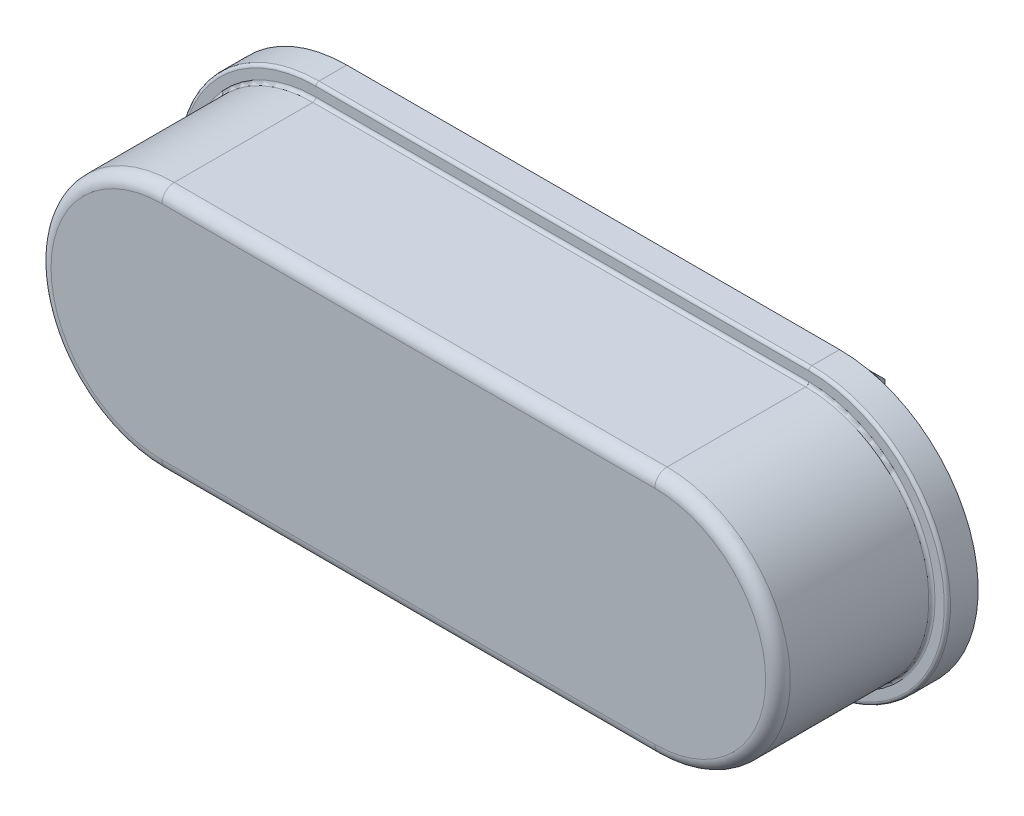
ISO-10303-21;
HEADER;
FILE_DESCRIPTION(('STEP AP214'),'2;1');
FILE_NAME('part.step','',(''),(''),'','','');
FILE_SCHEMA(('AUTOMOTIVE_DESIGN { 1 0 10303 214 1 1 1 1 }'));
ENDSEC;
DATA;
#1=APPLICATION_CONTEXT('core data for automotive mechanical design processes');
#2=APPLICATION_PROTOCOL_DEFINITION('international standard','automotive_design',2000,#1);
#3=PRODUCT_CONTEXT('',#1,'mechanical');
#4=PRODUCT('Part','Part','',(#3));
#5=PRODUCT_RELATED_PRODUCT_CATEGORY('part','',(#4));
#6=PRODUCT_DEFINITION_FORMATION('','',#4);
#7=PRODUCT_DEFINITION_CONTEXT('part definition',#1,'design');
#8=PRODUCT_DEFINITION('design','',#6,#7);
#9=PRODUCT_DEFINITION_SHAPE('','',#8);
#10=(LENGTH_UNIT() NAMED_UNIT(*) SI_UNIT(.MILLI.,.METRE.));
#11=(NAMED_UNIT(*) PLANE_ANGLE_UNIT() SI_UNIT($,.RADIAN.));
#12=(NAMED_UNIT(*) SI_UNIT($,.STERADIAN.) SOLID_ANGLE_UNIT());
#13=UNCERTAINTY_MEASURE_WITH_UNIT(LENGTH_MEASURE(1.E-05),#10,'distance_accuracy_value','');
#14=(GEOMETRIC_REPRESENTATION_CONTEXT(3) GLOBAL_UNCERTAINTY_ASSIGNED_CONTEXT((#13)) GLOBAL_UNIT_ASSIGNED_CONTEXT((#10,
#11,#12)) REPRESENTATION_CONTEXT('',''));
#15=CARTESIAN_POINT('',(0.,0.,0.));
#16=DIRECTION('',(0.,0.,1.));
#17=DIRECTION('',(1.,0.,0.));
#18=AXIS2_PLACEMENT_3D('',#15,#16,#17);
#19=CARTESIAN_POINT('',(-4.15,7.6,4.358));
#20=DIRECTION('',(0.,0.,1.));
#21=DIRECTION('',(0.,1.,0.));
#22=AXIS2_PLACEMENT_3D('',#19,#20,#21);
#23=TOROIDAL_SURFACE('',#22,1.8,0.2);
#24=CARTESIAN_POINT('',(-4.15,9.4,4.358));
#25=DIRECTION('',(1.,0.,0.));
#26=DIRECTION('',(0.,1.,0.));
#27=AXIS2_PLACEMENT_3D('',#24,#25,#26);
#28=CIRCLE('',#27,0.2);
#29=CARTESIAN_POINT('',(-4.15,9.6,4.358));
#30=VERTEX_POINT('',#29);
#31=CARTESIAN_POINT('',(-4.15,9.4,4.558));
#32=VERTEX_POINT('',#31);
#33=EDGE_CURVE('E41',#30,#32,#28,.T.);
#34=ORIENTED_EDGE('',*,*,#33,.F.);
#35=CARTESIAN_POINT('',(-4.15,7.6,4.358));
#36=DIRECTION('',(0.,0.,1.));
#37=DIRECTION('',(0.,1.,0.));
#38=AXIS2_PLACEMENT_3D('',#35,#36,#37);
#39=CIRCLE('',#38,2.);
#40=CARTESIAN_POINT('',(-4.15,5.6,4.358));
#41=VERTEX_POINT('',#40);
#42=EDGE_CURVE('E11',#30,#41,#39,.T.);
#43=ORIENTED_EDGE('',*,*,#42,.T.);
#44=CARTESIAN_POINT('',(-4.15,5.8,4.358));
#45=DIRECTION('',(-1.,0.,0.));
#46=DIRECTION('',(0.,-1.,0.));
#47=AXIS2_PLACEMENT_3D('',#44,#45,#46);
#48=CIRCLE('',#47,0.2);
#49=CARTESIAN_POINT('',(-4.15,5.8,4.558));
#50=VERTEX_POINT('',#49);
#51=EDGE_CURVE('E28',#41,#50,#48,.T.);
#52=ORIENTED_EDGE('',*,*,#51,.T.);
#53=CARTESIAN_POINT('',(-4.15,7.6,4.558));
#54=DIRECTION('',(0.,0.,1.));
#55=DIRECTION('',(0.,1.,0.));
#56=AXIS2_PLACEMENT_3D('',#53,#54,#55);
#57=CIRCLE('',#56,1.8);
#58=EDGE_CURVE('E340',#32,#50,#57,.T.);
#59=ORIENTED_EDGE('',*,*,#58,.F.);
#60=EDGE_LOOP('',(#34,#43,#52,#59));
#61=FACE_BOUND('',#60,.T.);
#62=ADVANCED_FACE('F17',(#61),#23,.T.);
#63=CARTESIAN_POINT('',(3.85,9.4,4.358));
#64=DIRECTION('',(-1.,0.,0.));
#65=DIRECTION('',(0.,1.,0.));
#66=AXIS2_PLACEMENT_3D('',#63,#64,#65);
#67=CYLINDRICAL_SURFACE('',#66,0.2);
#68=DIRECTION('',(-1.,0.,0.));
#69=VECTOR('',#68,1.);
#70=CARTESIAN_POINT('',(3.85,9.6,4.358));
#71=LINE('',#70,#69);
#72=CARTESIAN_POINT('',(3.85,9.6,4.358));
#73=VERTEX_POINT('',#72);
#74=EDGE_CURVE('E262',#73,#30,#71,.T.);
#75=ORIENTED_EDGE('',*,*,#74,.T.);
#76=ORIENTED_EDGE('',*,*,#33,.T.);
#77=DIRECTION('',(-1.,0.,0.));
#78=VECTOR('',#77,1.);
#79=CARTESIAN_POINT('',(3.85,9.4,4.558));
#80=LINE('',#79,#78);
#81=CARTESIAN_POINT('',(3.85,9.4,4.558));
#82=VERTEX_POINT('',#81);
#83=EDGE_CURVE('E311',#82,#32,#80,.T.);
#84=ORIENTED_EDGE('',*,*,#83,.F.);
#85=CARTESIAN_POINT('',(3.85,9.4,4.358));
#86=DIRECTION('',(1.,0.,0.));
#87=DIRECTION('',(0.,1.,0.));
#88=AXIS2_PLACEMENT_3D('',#85,#86,#87);
#89=CIRCLE('',#88,0.2);
#90=EDGE_CURVE('E283',#73,#82,#89,.T.);
#91=ORIENTED_EDGE('',*,*,#90,.F.);
#92=EDGE_LOOP('',(#75,#76,#84,#91));
#93=FACE_BOUND('',#92,.T.);
#94=ADVANCED_FACE('F449',(#93),#67,.T.);
#95=CARTESIAN_POINT('',(-4.15,5.8,4.358));
#96=DIRECTION('',(1.,0.,0.));
#97=DIRECTION('',(0.,-1.,0.));
#98=AXIS2_PLACEMENT_3D('',#95,#96,#97);
#99=CYLINDRICAL_SURFACE('',#98,0.2);
#100=DIRECTION('',(1.,0.,0.));
#101=VECTOR('',#100,1.);
#102=CARTESIAN_POINT('',(-4.15,5.6,4.358));
#103=LINE('',#102,#101);
#104=CARTESIAN_POINT('',(3.85,5.6,4.358));
#105=VERTEX_POINT('',#104);
#106=EDGE_CURVE('E342',#41,#105,#103,.T.);
#107=ORIENTED_EDGE('',*,*,#106,.T.);
#108=CARTESIAN_POINT('',(3.85,5.8,4.358));
#109=DIRECTION('',(-1.,0.,0.));
#110=DIRECTION('',(0.,-1.,0.));
#111=AXIS2_PLACEMENT_3D('',#108,#109,#110);
#112=CIRCLE('',#111,0.2);
#113=CARTESIAN_POINT('',(3.85,5.8,4.558));
#114=VERTEX_POINT('',#113);
#115=EDGE_CURVE('E282',#105,#114,#112,.T.);
#116=ORIENTED_EDGE('',*,*,#115,.T.);
#117=DIRECTION('',(1.,0.,0.));
#118=VECTOR('',#117,1.);
#119=CARTESIAN_POINT('',(-4.15,5.8,4.558));
#120=LINE('',#119,#118);
#121=EDGE_CURVE('E120',#50,#114,#120,.T.);
#122=ORIENTED_EDGE('',*,*,#121,.F.);
#123=ORIENTED_EDGE('',*,*,#51,.F.);
#124=EDGE_LOOP('',(#107,#116,#122,#123));
#125=FACE_BOUND('',#124,.T.);
#126=ADVANCED_FACE('F430',(#125),#99,.T.);
#127=CARTESIAN_POINT('',(3.85,7.6,4.358));
#128=DIRECTION('',(0.,0.,1.));
#129=DIRECTION('',(0.,-1.,0.));
#130=AXIS2_PLACEMENT_3D('',#127,#128,#129);
#131=TOROIDAL_SURFACE('',#130,1.8,0.2);
#132=ORIENTED_EDGE('',*,*,#115,.F.);
#133=CARTESIAN_POINT('',(3.85,7.6,4.358));
#134=DIRECTION('',(0.,0.,1.));
#135=DIRECTION('',(0.,-1.,0.));
#136=AXIS2_PLACEMENT_3D('',#133,#134,#135);
#137=CIRCLE('',#136,2.);
#138=EDGE_CURVE('E278',#105,#73,#137,.T.);
#139=ORIENTED_EDGE('',*,*,#138,.T.);
#140=ORIENTED_EDGE('',*,*,#90,.T.);
#141=CARTESIAN_POINT('',(3.85,7.6,4.558));
#142=DIRECTION('',(0.,0.,1.));
#143=DIRECTION('',(0.,-1.,0.));
#144=AXIS2_PLACEMENT_3D('',#141,#142,#143);
#145=CIRCLE('',#144,1.8);
#146=EDGE_CURVE('E308',#114,#82,#145,.T.);
#147=ORIENTED_EDGE('',*,*,#146,.F.);
#148=EDGE_LOOP('',(#132,#139,#140,#147));
#149=FACE_BOUND('',#148,.T.);
#150=ADVANCED_FACE('F428',(#149),#131,.T.);
#151=CARTESIAN_POINT('',(-4.15,7.6,2.058));
#152=DIRECTION('',(0.,0.,-1.));
#153=DIRECTION('',(1.,0.,0.));
#154=AXIS2_PLACEMENT_3D('',#151,#152,#153);
#155=CYLINDRICAL_SURFACE('',#154,2.);
#156=CARTESIAN_POINT('',(-4.15,7.6,2.108));
#157=DIRECTION('',(0.,0.,1.));
#158=DIRECTION('',(0.,1.,0.));
#159=AXIS2_PLACEMENT_3D('',#156,#157,#158);
#160=CIRCLE('',#159,2.);
#161=CARTESIAN_POINT('',(-4.15,9.6,2.108));
#162=VERTEX_POINT('',#161);
#163=CARTESIAN_POINT('',(-4.15,5.6,2.108));
#164=VERTEX_POINT('',#163);
#165=EDGE_CURVE('E346',#162,#164,#160,.T.);
#166=ORIENTED_EDGE('',*,*,#165,.T.);
#167=DIRECTION('',(0.,0.,1.));
#168=VECTOR('',#167,1.);
#169=CARTESIAN_POINT('',(-4.15,5.6,2.058));
#170=LINE('',#169,#168);
#171=EDGE_CURVE('E324',#164,#41,#170,.T.);
#172=ORIENTED_EDGE('',*,*,#171,.T.);
#173=ORIENTED_EDGE('',*,*,#42,.F.);
#174=DIRECTION('',(0.,0.,1.));
#175=VECTOR('',#174,1.);
#176=CARTESIAN_POINT('',(-4.15,9.6,2.058));
#177=LINE('',#176,#175);
#178=EDGE_CURVE('E257',#162,#30,#177,.T.);
#179=ORIENTED_EDGE('',*,*,#178,.F.);
#180=EDGE_LOOP('',(#166,#172,#173,#179));
#181=FACE_BOUND('',#180,.T.);
#182=ADVANCED_FACE('F433',(#181),#155,.T.);
#183=CARTESIAN_POINT('',(3.85,9.6,2.058));
#184=DIRECTION('',(0.,-1.,0.));
#185=DIRECTION('',(-1.,0.,0.));
#186=AXIS2_PLACEMENT_3D('',#183,#184,#185);
#187=PLANE('',#186);
#188=DIRECTION('',(-1.,0.,0.));
#189=VECTOR('',#188,1.);
#190=CARTESIAN_POINT('',(3.85,9.6,2.108));
#191=LINE('',#190,#189);
#192=CARTESIAN_POINT('',(3.85,9.6,2.108));
#193=VERTEX_POINT('',#192);
#194=EDGE_CURVE('E320',#193,#162,#191,.T.);
#195=ORIENTED_EDGE('',*,*,#194,.T.);
#196=ORIENTED_EDGE('',*,*,#178,.T.);
#197=ORIENTED_EDGE('',*,*,#74,.F.);
#198=DIRECTION('',(0.,0.,1.));
#199=VECTOR('',#198,1.);
#200=CARTESIAN_POINT('',(3.85,9.6,2.058));
#201=LINE('',#200,#199);
#202=EDGE_CURVE('E325',#193,#73,#201,.T.);
#203=ORIENTED_EDGE('',*,*,#202,.F.);
#204=EDGE_LOOP('',(#195,#196,#197,#203));
#205=FACE_BOUND('',#204,.T.);
#206=ADVANCED_FACE('F447',(#205),#187,.F.);
#207=CARTESIAN_POINT('',(-4.15,5.6,2.058));
#208=DIRECTION('',(0.,1.,0.));
#209=DIRECTION('',(1.,0.,0.));
#210=AXIS2_PLACEMENT_3D('',#207,#208,#209);
#211=PLANE('',#210);
#212=DIRECTION('',(1.,0.,0.));
#213=VECTOR('',#212,1.);
#214=CARTESIAN_POINT('',(-4.15,5.6,2.108));
#215=LINE('',#214,#213);
#216=CARTESIAN_POINT('',(3.85,5.6,2.108));
#217=VERTEX_POINT('',#216);
#218=EDGE_CURVE('E107',#164,#217,#215,.T.);
#219=ORIENTED_EDGE('',*,*,#218,.T.);
#220=DIRECTION('',(0.,0.,1.));
#221=VECTOR('',#220,1.);
#222=CARTESIAN_POINT('',(3.85,5.6,2.058));
#223=LINE('',#222,#221);
#224=EDGE_CURVE('E258',#217,#105,#223,.T.);
#225=ORIENTED_EDGE('',*,*,#224,.T.);
#226=ORIENTED_EDGE('',*,*,#106,.F.);
#227=ORIENTED_EDGE('',*,*,#171,.F.);
#228=EDGE_LOOP('',(#219,#225,#226,#227));
#229=FACE_BOUND('',#228,.T.);
#230=ADVANCED_FACE('F419',(#229),#211,.F.);
#231=CARTESIAN_POINT('',(3.85,7.6,2.058));
#232=DIRECTION('',(0.,0.,-1.));
#233=DIRECTION('',(1.,0.,0.));
#234=AXIS2_PLACEMENT_3D('',#231,#232,#233);
#235=CYLINDRICAL_SURFACE('',#234,2.);
#236=CARTESIAN_POINT('',(3.85,7.6,2.108));
#237=DIRECTION('',(0.,0.,1.));
#238=DIRECTION('',(0.,-1.,0.));
#239=AXIS2_PLACEMENT_3D('',#236,#237,#238);
#240=CIRCLE('',#239,2.);
#241=EDGE_CURVE('E329',#217,#193,#240,.T.);
#242=ORIENTED_EDGE('',*,*,#241,.T.);
#243=ORIENTED_EDGE('',*,*,#202,.T.);
#244=ORIENTED_EDGE('',*,*,#138,.F.);
#245=ORIENTED_EDGE('',*,*,#224,.F.);
#246=EDGE_LOOP('',(#242,#243,#244,#245));
#247=FACE_BOUND('',#246,.T.);
#248=ADVANCED_FACE('F422',(#247),#235,.T.);
#249=CARTESIAN_POINT('',(-4.15,7.6,2.108));
#250=DIRECTION('',(0.,0.,1.));
#251=DIRECTION('',(0.,1.,0.));
#252=AXIS2_PLACEMENT_3D('',#249,#250,#251);
#253=TOROIDAL_SURFACE('',#252,2.05,0.05);
#254=CARTESIAN_POINT('',(-4.15,7.6,2.058));
#255=DIRECTION('',(0.,0.,1.));
#256=DIRECTION('',(0.,1.,0.));
#257=AXIS2_PLACEMENT_3D('',#254,#255,#256);
#258=CIRCLE('',#257,2.05);
#259=CARTESIAN_POINT('',(-4.15,9.65,2.058));
#260=VERTEX_POINT('',#259);
#261=CARTESIAN_POINT('',(-4.15,5.55,2.058));
#262=VERTEX_POINT('',#261);
#263=EDGE_CURVE('E330',#260,#262,#258,.T.);
#264=ORIENTED_EDGE('',*,*,#263,.T.);
#265=CARTESIAN_POINT('',(-4.15,5.55,2.108));
#266=DIRECTION('',(-1.,0.,0.));
#267=DIRECTION('',(0.,-1.,0.));
#268=AXIS2_PLACEMENT_3D('',#265,#266,#267);
#269=CIRCLE('',#268,0.05);
#270=EDGE_CURVE('E286',#164,#262,#269,.T.);
#271=ORIENTED_EDGE('',*,*,#270,.F.);
#272=ORIENTED_EDGE('',*,*,#165,.F.);
#273=CARTESIAN_POINT('',(-4.15,9.65,2.108));
#274=DIRECTION('',(1.,0.,0.));
#275=DIRECTION('',(0.,1.,0.));
#276=AXIS2_PLACEMENT_3D('',#273,#274,#275);
#277=CIRCLE('',#276,0.05);
#278=EDGE_CURVE('E333',#162,#260,#277,.T.);
#279=ORIENTED_EDGE('',*,*,#278,.T.);
#280=EDGE_LOOP('',(#264,#271,#272,#279));
#281=FACE_BOUND('',#280,.T.);
#282=ADVANCED_FACE('F438',(#281),#253,.F.);
#283=CARTESIAN_POINT('',(3.85,9.65,2.108));
#284=DIRECTION('',(-1.,0.,0.));
#285=DIRECTION('',(0.,-1.,0.));
#286=AXIS2_PLACEMENT_3D('',#283,#284,#285);
#287=CYLINDRICAL_SURFACE('',#286,0.05);
#288=CARTESIAN_POINT('',(3.85,9.65,2.108));
#289=DIRECTION('',(1.,0.,0.));
#290=DIRECTION('',(0.,1.,0.));
#291=AXIS2_PLACEMENT_3D('',#288,#289,#290);
#292=CIRCLE('',#291,0.05);
#293=CARTESIAN_POINT('',(3.85,9.65,2.058));
#294=VERTEX_POINT('',#293);
#295=EDGE_CURVE('E285',#193,#294,#292,.T.);
#296=ORIENTED_EDGE('',*,*,#295,.T.);
#297=DIRECTION('',(-1.,0.,0.));
#298=VECTOR('',#297,1.);
#299=CARTESIAN_POINT('',(3.85,9.65,2.058));
#300=LINE('',#299,#298);
#301=EDGE_CURVE('E145',#294,#260,#300,.T.);
#302=ORIENTED_EDGE('',*,*,#301,.T.);
#303=ORIENTED_EDGE('',*,*,#278,.F.);
#304=ORIENTED_EDGE('',*,*,#194,.F.);
#305=EDGE_LOOP('',(#296,#302,#303,#304));
#306=FACE_BOUND('',#305,.T.);
#307=ADVANCED_FACE('F445',(#306),#287,.F.);
#308=CARTESIAN_POINT('',(-4.15,5.55,2.108));
#309=DIRECTION('',(1.,0.,0.));
#310=DIRECTION('',(0.,1.,0.));
#311=AXIS2_PLACEMENT_3D('',#308,#309,#310);
#312=CYLINDRICAL_SURFACE('',#311,0.05);
#313=ORIENTED_EDGE('',*,*,#270,.T.);
#314=DIRECTION('',(1.,0.,0.));
#315=VECTOR('',#314,1.);
#316=CARTESIAN_POINT('',(-4.15,5.55,2.058));
#317=LINE('',#316,#315);
#318=CARTESIAN_POINT('',(3.85,5.55,2.058));
#319=VERTEX_POINT('',#318);
#320=EDGE_CURVE('E299',#262,#319,#317,.T.);
#321=ORIENTED_EDGE('',*,*,#320,.T.);
#322=CARTESIAN_POINT('',(3.85,5.55,2.108));
#323=DIRECTION('',(-1.,0.,0.));
#324=DIRECTION('',(0.,1.,0.));
#325=AXIS2_PLACEMENT_3D('',#322,#323,#324);
#326=CIRCLE('',#325,0.05);
#327=EDGE_CURVE('E155',#217,#319,#326,.T.);
#328=ORIENTED_EDGE('',*,*,#327,.F.);
#329=ORIENTED_EDGE('',*,*,#218,.F.);
#330=EDGE_LOOP('',(#313,#321,#328,#329));
#331=FACE_BOUND('',#330,.T.);
#332=ADVANCED_FACE('F440',(#331),#312,.F.);
#333=CARTESIAN_POINT('',(3.85,7.6,2.108));
#334=DIRECTION('',(0.,0.,1.));
#335=DIRECTION('',(0.,-1.,0.));
#336=AXIS2_PLACEMENT_3D('',#333,#334,#335);
#337=TOROIDAL_SURFACE('',#336,2.05,0.05);
#338=CARTESIAN_POINT('',(3.85,7.6,2.058));
#339=DIRECTION('',(0.,0.,1.));
#340=DIRECTION('',(0.,-1.,0.));
#341=AXIS2_PLACEMENT_3D('',#338,#339,#340);
#342=CIRCLE('',#341,2.05);
#343=EDGE_CURVE('E306',#319,#294,#342,.T.);
#344=ORIENTED_EDGE('',*,*,#343,.T.);
#345=ORIENTED_EDGE('',*,*,#295,.F.);
#346=ORIENTED_EDGE('',*,*,#241,.F.);
#347=ORIENTED_EDGE('',*,*,#327,.T.);
#348=EDGE_LOOP('',(#344,#345,#346,#347));
#349=FACE_BOUND('',#348,.T.);
#350=ADVANCED_FACE('F443',(#349),#337,.F.);
#351=CARTESIAN_POINT('',(-0.15,7.6,2.058));
#352=DIRECTION('',(0.,0.,1.));
#353=DIRECTION('',(1.,0.,0.));
#354=AXIS2_PLACEMENT_3D('',#351,#352,#353);
#355=PLANE('',#354);
#356=CARTESIAN_POINT('',(-4.15,7.6,2.058));
#357=DIRECTION('',(0.,0.,1.));
#358=DIRECTION('',(0.,1.,0.));
#359=AXIS2_PLACEMENT_3D('',#356,#357,#358);
#360=CIRCLE('',#359,2.2);
#361=CARTESIAN_POINT('',(-4.15,9.8,2.058));
#362=VERTEX_POINT('',#361);
#363=CARTESIAN_POINT('',(-4.15,5.4,2.058));
#364=VERTEX_POINT('',#363);
#365=EDGE_CURVE('E307',#362,#364,#360,.T.);
#366=ORIENTED_EDGE('',*,*,#365,.T.);
#367=DIRECTION('',(1.,0.,0.));
#368=VECTOR('',#367,1.);
#369=CARTESIAN_POINT('',(-4.15,5.4,2.058));
#370=LINE('',#369,#368);
#371=CARTESIAN_POINT('',(3.85,5.4,2.058));
#372=VERTEX_POINT('',#371);
#373=EDGE_CURVE('E221',#364,#372,#370,.T.);
#374=ORIENTED_EDGE('',*,*,#373,.T.);
#375=CARTESIAN_POINT('',(3.85,7.6,2.058));
#376=DIRECTION('',(0.,0.,1.));
#377=DIRECTION('',(0.,-1.,0.));
#378=AXIS2_PLACEMENT_3D('',#375,#376,#377);
#379=CIRCLE('',#378,2.2);
#380=CARTESIAN_POINT('',(3.85,9.8,2.058));
#381=VERTEX_POINT('',#380);
#382=EDGE_CURVE('E265',#372,#381,#379,.T.);
#383=ORIENTED_EDGE('',*,*,#382,.T.);
#384=DIRECTION('',(-1.,0.,0.));
#385=VECTOR('',#384,1.);
#386=CARTESIAN_POINT('',(3.85,9.8,2.058));
#387=LINE('',#386,#385);
#388=EDGE_CURVE('E234',#381,#362,#387,.T.);
#389=ORIENTED_EDGE('',*,*,#388,.T.);
#390=EDGE_LOOP('',(#366,#374,#383,#389));
#391=FACE_BOUND('',#390,.T.);
#392=ORIENTED_EDGE('',*,*,#263,.F.);
#393=ORIENTED_EDGE('',*,*,#301,.F.);
#394=ORIENTED_EDGE('',*,*,#343,.F.);
#395=ORIENTED_EDGE('',*,*,#320,.F.);
#396=EDGE_LOOP('',(#392,#393,#394,#395));
#397=FACE_BOUND('',#396,.T.);
#398=ADVANCED_FACE('F441',(#391,#397),#355,.T.);
#399=CARTESIAN_POINT('',(-4.15,7.6,2.008));
#400=DIRECTION('',(0.,0.,-1.));
#401=DIRECTION('',(0.,1.,0.));
#402=AXIS2_PLACEMENT_3D('',#399,#400,#401);
#403=TOROIDAL_SURFACE('',#402,2.2,0.05);
#404=CARTESIAN_POINT('',(-4.15,7.6,2.008));
#405=DIRECTION('',(0.,0.,1.));
#406=DIRECTION('',(0.,1.,0.));
#407=AXIS2_PLACEMENT_3D('',#404,#405,#406);
#408=CIRCLE('',#407,2.25);
#409=CARTESIAN_POINT('',(-4.15,9.85,2.008));
#410=VERTEX_POINT('',#409);
#411=CARTESIAN_POINT('',(-4.15,5.35,2.008));
#412=VERTEX_POINT('',#411);
#413=EDGE_CURVE('E228',#410,#412,#408,.T.);
#414=ORIENTED_EDGE('',*,*,#413,.T.);
#415=CARTESIAN_POINT('',(-4.15,5.4,2.008));
#416=DIRECTION('',(1.,0.,0.));
#417=DIRECTION('',(0.,-1.,0.));
#418=AXIS2_PLACEMENT_3D('',#415,#416,#417);
#419=CIRCLE('',#418,0.05);
#420=EDGE_CURVE('E215',#364,#412,#419,.T.);
#421=ORIENTED_EDGE('',*,*,#420,.F.);
#422=ORIENTED_EDGE('',*,*,#365,.F.);
#423=CARTESIAN_POINT('',(-4.15,9.8,2.008));
#424=DIRECTION('',(-1.,0.,0.));
#425=DIRECTION('',(0.,1.,0.));
#426=AXIS2_PLACEMENT_3D('',#423,#424,#425);
#427=CIRCLE('',#426,0.05);
#428=EDGE_CURVE('E230',#362,#410,#427,.T.);
#429=ORIENTED_EDGE('',*,*,#428,.T.);
#430=EDGE_LOOP('',(#414,#421,#422,#429));
#431=FACE_BOUND('',#430,.T.);
#432=ADVANCED_FACE('F229',(#431),#403,.T.);
#433=CARTESIAN_POINT('',(3.85,9.8,2.008));
#434=DIRECTION('',(-1.,0.,0.));
#435=DIRECTION('',(0.,0.,1.));
#436=AXIS2_PLACEMENT_3D('',#433,#434,#435);
#437=CYLINDRICAL_SURFACE('',#436,0.05);
#438=CARTESIAN_POINT('',(3.85,9.8,2.008));
#439=DIRECTION('',(-1.,0.,0.));
#440=DIRECTION('',(0.,1.,0.));
#441=AXIS2_PLACEMENT_3D('',#438,#439,#440);
#442=CIRCLE('',#441,0.05);
#443=CARTESIAN_POINT('',(3.85,9.85,2.008));
#444=VERTEX_POINT('',#443);
#445=EDGE_CURVE('E290',#381,#444,#442,.T.);
#446=ORIENTED_EDGE('',*,*,#445,.T.);
#447=DIRECTION('',(-1.,0.,0.));
#448=VECTOR('',#447,1.);
#449=CARTESIAN_POINT('',(3.85,9.85,2.008));
#450=LINE('',#449,#448);
#451=EDGE_CURVE('E196',#444,#410,#450,.T.);
#452=ORIENTED_EDGE('',*,*,#451,.T.);
#453=ORIENTED_EDGE('',*,*,#428,.F.);
#454=ORIENTED_EDGE('',*,*,#388,.F.);
#455=EDGE_LOOP('',(#446,#452,#453,#454));
#456=FACE_BOUND('',#455,.T.);
#457=ADVANCED_FACE('F614',(#456),#437,.T.);
#458=CARTESIAN_POINT('',(-4.15,5.4,2.008));
#459=DIRECTION('',(1.,0.,0.));
#460=DIRECTION('',(0.,0.,1.));
#461=AXIS2_PLACEMENT_3D('',#458,#459,#460);
#462=CYLINDRICAL_SURFACE('',#461,0.05);
#463=ORIENTED_EDGE('',*,*,#420,.T.);
#464=DIRECTION('',(1.,0.,0.));
#465=VECTOR('',#464,1.);
#466=CARTESIAN_POINT('',(-4.15,5.35,2.008));
#467=LINE('',#466,#465);
#468=CARTESIAN_POINT('',(3.85,5.35,2.008));
#469=VERTEX_POINT('',#468);
#470=EDGE_CURVE('E204',#412,#469,#467,.T.);
#471=ORIENTED_EDGE('',*,*,#470,.T.);
#472=CARTESIAN_POINT('',(3.85,5.4,2.008));
#473=DIRECTION('',(1.,0.,0.));
#474=DIRECTION('',(0.,0.,1.));
#475=AXIS2_PLACEMENT_3D('',#472,#473,#474);
#476=CIRCLE('',#475,0.05);
#477=EDGE_CURVE('E248',#372,#469,#476,.T.);
#478=ORIENTED_EDGE('',*,*,#477,.F.);
#479=ORIENTED_EDGE('',*,*,#373,.F.);
#480=EDGE_LOOP('',(#463,#471,#478,#479));
#481=FACE_BOUND('',#480,.T.);
#482=ADVANCED_FACE('F219',(#481),#462,.T.);
#483=CARTESIAN_POINT('',(3.85,7.6,2.008));
#484=DIRECTION('',(0.,0.,-1.));
#485=DIRECTION('',(0.,-1.,0.));
#486=AXIS2_PLACEMENT_3D('',#483,#484,#485);
#487=TOROIDAL_SURFACE('',#486,2.2,0.05);
#488=CARTESIAN_POINT('',(3.85,7.6,2.008));
#489=DIRECTION('',(0.,0.,1.));
#490=DIRECTION('',(0.,-1.,0.));
#491=AXIS2_PLACEMENT_3D('',#488,#489,#490);
#492=CIRCLE('',#491,2.25);
#493=EDGE_CURVE('E21',#469,#444,#492,.T.);
#494=ORIENTED_EDGE('',*,*,#493,.T.);
#495=ORIENTED_EDGE('',*,*,#445,.F.);
#496=ORIENTED_EDGE('',*,*,#382,.F.);
#497=ORIENTED_EDGE('',*,*,#477,.T.);
#498=EDGE_LOOP('',(#494,#495,#496,#497));
#499=FACE_BOUND('',#498,.T.);
#500=ADVANCED_FACE('F595',(#499),#487,.T.);
#501=CARTESIAN_POINT('',(-4.15,7.6,1.558));
#502=DIRECTION('',(0.,0.,-1.));
#503=DIRECTION('',(1.,0.,0.));
#504=AXIS2_PLACEMENT_3D('',#501,#502,#503);
#505=CYLINDRICAL_SURFACE('',#504,2.25);
#506=CARTESIAN_POINT('',(-4.15,7.6,1.558));
#507=DIRECTION('',(0.,0.,1.));
#508=DIRECTION('',(1.,0.,0.));
#509=AXIS2_PLACEMENT_3D('',#506,#507,#508);
#510=CIRCLE('',#509,2.25);
#511=CARTESIAN_POINT('',(-4.15,9.85,1.558));
#512=VERTEX_POINT('',#511);
#513=CARTESIAN_POINT('',(-4.15,5.35,1.558));
#514=VERTEX_POINT('',#513);
#515=EDGE_CURVE('E238',#512,#514,#510,.T.);
#516=ORIENTED_EDGE('',*,*,#515,.T.);
#517=DIRECTION('',(0.,0.,1.));
#518=VECTOR('',#517,1.);
#519=CARTESIAN_POINT('',(-4.15,5.35,1.558));
#520=LINE('',#519,#518);
#521=EDGE_CURVE('E209',#514,#412,#520,.T.);
#522=ORIENTED_EDGE('',*,*,#521,.T.);
#523=ORIENTED_EDGE('',*,*,#413,.F.);
#524=DIRECTION('',(0.,0.,1.));
#525=VECTOR('',#524,1.);
#526=CARTESIAN_POINT('',(-4.15,9.85,1.558));
#527=LINE('',#526,#525);
#528=EDGE_CURVE('E251',#512,#410,#527,.T.);
#529=ORIENTED_EDGE('',*,*,#528,.F.);
#530=EDGE_LOOP('',(#516,#522,#523,#529));
#531=FACE_BOUND('',#530,.T.);
#532=ADVANCED_FACE('F236',(#531),#505,.T.);
#533=CARTESIAN_POINT('',(3.85,9.85,1.558));
#534=DIRECTION('',(0.,-1.,0.));
#535=DIRECTION('',(0.,0.,-1.));
#536=AXIS2_PLACEMENT_3D('',#533,#534,#535);
#537=PLANE('',#536);
#538=DIRECTION('',(-1.,0.,0.));
#539=VECTOR('',#538,1.);
#540=CARTESIAN_POINT('',(3.85,9.85,1.558));
#541=LINE('',#540,#539);
#542=CARTESIAN_POINT('',(3.85,9.85,1.558));
#543=VERTEX_POINT('',#542);
#544=EDGE_CURVE('E241',#543,#512,#541,.T.);
#545=ORIENTED_EDGE('',*,*,#544,.T.);
#546=ORIENTED_EDGE('',*,*,#528,.T.);
#547=ORIENTED_EDGE('',*,*,#451,.F.);
#548=DIRECTION('',(0.,0.,1.));
#549=VECTOR('',#548,1.);
#550=CARTESIAN_POINT('',(3.85,9.85,1.558));
#551=LINE('',#550,#549);
#552=EDGE_CURVE('E295',#543,#444,#551,.T.);
#553=ORIENTED_EDGE('',*,*,#552,.F.);
#554=EDGE_LOOP('',(#545,#546,#547,#553));
#555=FACE_BOUND('',#554,.T.);
#556=ADVANCED_FACE('F594',(#555),#537,.F.);
#557=CARTESIAN_POINT('',(-4.15,5.35,1.558));
#558=DIRECTION('',(0.,1.,0.));
#559=DIRECTION('',(1.,0.,0.));
#560=AXIS2_PLACEMENT_3D('',#557,#558,#559);
#561=PLANE('',#560);
#562=DIRECTION('',(1.,0.,0.));
#563=VECTOR('',#562,1.);
#564=CARTESIAN_POINT('',(-4.15,5.35,1.558));
#565=LINE('',#564,#563);
#566=CARTESIAN_POINT('',(3.85,5.35,1.558));
#567=VERTEX_POINT('',#566);
#568=EDGE_CURVE('E269',#514,#567,#565,.T.);
#569=ORIENTED_EDGE('',*,*,#568,.T.);
#570=DIRECTION('',(0.,0.,1.));
#571=VECTOR('',#570,1.);
#572=CARTESIAN_POINT('',(3.85,5.35,1.558));
#573=LINE('',#572,#571);
#574=EDGE_CURVE('E211',#567,#469,#573,.T.);
#575=ORIENTED_EDGE('',*,*,#574,.T.);
#576=ORIENTED_EDGE('',*,*,#470,.F.);
#577=ORIENTED_EDGE('',*,*,#521,.F.);
#578=EDGE_LOOP('',(#569,#575,#576,#577));
#579=FACE_BOUND('',#578,.T.);
#580=ADVANCED_FACE('F207',(#579),#561,.F.);
#581=CARTESIAN_POINT('',(3.85,7.6,1.558));
#582=DIRECTION('',(0.,0.,-1.));
#583=DIRECTION('',(1.,0.,0.));
#584=AXIS2_PLACEMENT_3D('',#581,#582,#583);
#585=CYLINDRICAL_SURFACE('',#584,2.25);
#586=CARTESIAN_POINT('',(3.85,7.6,1.558));
#587=DIRECTION('',(0.,0.,1.));
#588=DIRECTION('',(1.,0.,0.));
#589=AXIS2_PLACEMENT_3D('',#586,#587,#588);
#590=CIRCLE('',#589,2.25);
#591=EDGE_CURVE('E316',#567,#543,#590,.T.);
#592=ORIENTED_EDGE('',*,*,#591,.T.);
#593=ORIENTED_EDGE('',*,*,#552,.T.);
#594=ORIENTED_EDGE('',*,*,#493,.F.);
#595=ORIENTED_EDGE('',*,*,#574,.F.);
#596=EDGE_LOOP('',(#592,#593,#594,#595));
#597=FACE_BOUND('',#596,.T.);
#598=ADVANCED_FACE('F569',(#597),#585,.T.);
#599=CARTESIAN_POINT('',(-0.15,7.6,1.558));
#600=DIRECTION('',(0.,0.,1.));
#601=DIRECTION('',(1.,0.,0.));
#602=AXIS2_PLACEMENT_3D('',#599,#600,#601);
#603=PLANE('',#602);
#604=ORIENTED_EDGE('',*,*,#544,.F.);
#605=ORIENTED_EDGE('',*,*,#591,.F.);
#606=ORIENTED_EDGE('',*,*,#568,.F.);
#607=ORIENTED_EDGE('',*,*,#515,.F.);
#608=EDGE_LOOP('',(#604,#605,#606,#607));
#609=FACE_BOUND('',#608,.T.);
#610=CARTESIAN_POINT('',(2.39,7.6,1.558));
#611=DIRECTION('',(0.,0.,-1.));
#612=DIRECTION('',(1.,0.,0.));
#613=AXIS2_PLACEMENT_3D('',#610,#611,#612);
#614=CIRCLE('',#613,0.25);
#615=CARTESIAN_POINT('',(2.64,7.6,1.558));
#616=VERTEX_POINT('',#615);
#617=EDGE_CURVE('E291',#616,#616,#614,.T.);
#618=ORIENTED_EDGE('',*,*,#617,.F.);
#619=EDGE_LOOP('',(#618));
#620=FACE_BOUND('',#619,.T.);
#621=CARTESIAN_POINT('',(-2.69,7.6,1.558));
#622=DIRECTION('',(0.,0.,-1.));
#623=DIRECTION('',(1.,0.,0.));
#624=AXIS2_PLACEMENT_3D('',#621,#622,#623);
#625=CIRCLE('',#624,0.25);
#626=CARTESIAN_POINT('',(-2.44,7.6,1.558));
#627=VERTEX_POINT('',#626);
#628=EDGE_CURVE('E303',#627,#627,#625,.T.);
#629=ORIENTED_EDGE('',*,*,#628,.F.);
#630=EDGE_LOOP('',(#629));
#631=FACE_BOUND('',#630,.T.);
#632=ADVANCED_FACE('F567',(#609,#620,#631),#603,.F.);
#633=CARTESIAN_POINT('',(2.39,7.6,1.558));
#634=DIRECTION('',(0.,0.,1.));
#635=DIRECTION('',(1.,0.,0.));
#636=AXIS2_PLACEMENT_3D('',#633,#634,#635);
#637=CYLINDRICAL_SURFACE('',#636,0.25);
#638=ORIENTED_EDGE('',*,*,#617,.T.);
#639=DIRECTION('',(0.,0.,-1.));
#640=VECTOR('',#639,1.);
#641=CARTESIAN_POINT('',(2.64,7.6,1.558));
#642=LINE('',#641,#640);
#643=CARTESIAN_POINT('',(2.64,7.6,-0.393));
#644=VERTEX_POINT('',#643);
#645=EDGE_CURVE('E296',#616,#644,#642,.T.);
#646=ORIENTED_EDGE('',*,*,#645,.T.);
#647=CARTESIAN_POINT('',(2.39,7.6,-0.393));
#648=DIRECTION('',(0.,0.,-1.));
#649=DIRECTION('',(1.,0.,0.));
#650=AXIS2_PLACEMENT_3D('',#647,#648,#649);
#651=CIRCLE('',#650,0.25);
#652=EDGE_CURVE('E376',#644,#644,#651,.T.);
#653=ORIENTED_EDGE('',*,*,#652,.F.);
#654=ORIENTED_EDGE('',*,*,#645,.F.);
#655=EDGE_LOOP('',(#638,#646,#653,#654));
#656=FACE_BOUND('',#655,.T.);
#657=ADVANCED_FACE('F19',(#656),#637,.T.);
#658=CARTESIAN_POINT('',(-2.69,7.6,1.558));
#659=DIRECTION('',(0.,0.,1.));
#660=DIRECTION('',(1.,0.,0.));
#661=AXIS2_PLACEMENT_3D('',#658,#659,#660);
#662=CYLINDRICAL_SURFACE('',#661,0.25);
#663=ORIENTED_EDGE('',*,*,#628,.T.);
#664=DIRECTION('',(0.,0.,-1.));
#665=VECTOR('',#664,1.);
#666=CARTESIAN_POINT('',(-2.44,7.6,1.558));
#667=LINE('',#666,#665);
#668=CARTESIAN_POINT('',(-2.44,7.6,-0.393));
#669=VERTEX_POINT('',#668);
#670=EDGE_CURVE('E372',#627,#669,#667,.T.);
#671=ORIENTED_EDGE('',*,*,#670,.T.);
#672=CARTESIAN_POINT('',(-2.69,7.6,-0.393));
#673=DIRECTION('',(0.,0.,-1.));
#674=DIRECTION('',(1.,0.,0.));
#675=AXIS2_PLACEMENT_3D('',#672,#673,#674);
#676=CIRCLE('',#675,0.25);
#677=EDGE_CURVE('E276',#669,#669,#676,.T.);
#678=ORIENTED_EDGE('',*,*,#677,.F.);
#679=ORIENTED_EDGE('',*,*,#670,.F.);
#680=EDGE_LOOP('',(#663,#671,#678,#679));
#681=FACE_BOUND('',#680,.T.);
#682=ADVANCED_FACE('F565',(#681),#662,.T.);
#683=CARTESIAN_POINT('',(2.39,7.6,-0.393));
#684=DIRECTION('',(0.,0.,1.));
#685=DIRECTION('',(1.,0.,0.));
#686=AXIS2_PLACEMENT_3D('',#683,#684,#685);
#687=CONICAL_SURFACE('',#686,0.25,0.785398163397);
#688=DIRECTION('',(-0.707106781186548,0.,-0.707106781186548));
#689=VECTOR('',#688,1.);
#690=CARTESIAN_POINT('',(2.64,7.6,-0.393));
#691=LINE('',#690,#689);
#692=CARTESIAN_POINT('',(2.391,7.6,-0.642));
#693=VERTEX_POINT('',#692);
#694=EDGE_CURVE('E391',#644,#693,#691,.T.);
#695=ORIENTED_EDGE('',*,*,#694,.F.);
#696=ORIENTED_EDGE('',*,*,#652,.T.);
#697=ORIENTED_EDGE('',*,*,#694,.T.);
#698=CARTESIAN_POINT('',(2.39,7.6,-0.642));
#699=DIRECTION('',(0.,0.,-1.));
#700=DIRECTION('',(1.,0.,0.));
#701=AXIS2_PLACEMENT_3D('',#698,#699,#700);
#702=CIRCLE('',#701,0.001);
#703=EDGE_CURVE('E277',#693,#693,#702,.T.);
#704=ORIENTED_EDGE('',*,*,#703,.F.);
#705=EDGE_LOOP('',(#695,#696,#697,#704));
#706=FACE_BOUND('',#705,.T.);
#707=ADVANCED_FACE('F617',(#706),#687,.T.);
#708=CARTESIAN_POINT('',(-2.69,7.6,-0.393));
#709=DIRECTION('',(0.,0.,1.));
#710=DIRECTION('',(1.,0.,0.));
#711=AXIS2_PLACEMENT_3D('',#708,#709,#710);
#712=CONICAL_SURFACE('',#711,0.25,0.785398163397);
#713=DIRECTION('',(-0.707106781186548,0.,-0.707106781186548));
#714=VECTOR('',#713,1.);
#715=CARTESIAN_POINT('',(-2.44,7.6,-0.393));
#716=LINE('',#715,#714);
#717=CARTESIAN_POINT('',(-2.689,7.6,-0.642));
#718=VERTEX_POINT('',#717);
#719=EDGE_CURVE('E272',#669,#718,#716,.T.);
#720=ORIENTED_EDGE('',*,*,#719,.F.);
#721=ORIENTED_EDGE('',*,*,#677,.T.);
#722=ORIENTED_EDGE('',*,*,#719,.T.);
#723=CARTESIAN_POINT('',(-2.69,7.6,-0.642));
#724=DIRECTION('',(0.,0.,-1.));
#725=DIRECTION('',(1.,0.,0.));
#726=AXIS2_PLACEMENT_3D('',#723,#724,#725);
#727=CIRCLE('',#726,0.001);
#728=EDGE_CURVE('E336',#718,#718,#727,.T.);
#729=ORIENTED_EDGE('',*,*,#728,.F.);
#730=EDGE_LOOP('',(#720,#721,#722,#729));
#731=FACE_BOUND('',#730,.T.);
#732=ADVANCED_FACE('F600',(#731),#712,.T.);
#733=CARTESIAN_POINT('',(2.39,7.6,-0.642));
#734=DIRECTION('',(0.,0.,-1.));
#735=DIRECTION('',(0.,-1.,0.));
#736=AXIS2_PLACEMENT_3D('',#733,#734,#735);
#737=PLANE('',#736);
#738=ORIENTED_EDGE('',*,*,#703,.T.);
#739=EDGE_LOOP('',(#738));
#740=FACE_BOUND('',#739,.T.);
#741=ADVANCED_FACE('F596',(#740),#737,.T.);
#742=CARTESIAN_POINT('',(-2.69,7.6,-0.642));
#743=DIRECTION('',(0.,0.,-1.));
#744=DIRECTION('',(0.,-1.,0.));
#745=AXIS2_PLACEMENT_3D('',#742,#743,#744);
#746=PLANE('',#745);
#747=ORIENTED_EDGE('',*,*,#728,.T.);
#748=EDGE_LOOP('',(#747));
#749=FACE_BOUND('',#748,.T.);
#750=ADVANCED_FACE('F599',(#749),#746,.T.);
#751=CARTESIAN_POINT('',(-0.15,7.6,4.558));
#752=DIRECTION('',(0.,0.,1.));
#753=DIRECTION('',(1.,0.,0.));
#754=AXIS2_PLACEMENT_3D('',#751,#752,#753);
#755=PLANE('',#754);
#756=ORIENTED_EDGE('',*,*,#58,.T.);
#757=ORIENTED_EDGE('',*,*,#121,.T.);
#758=ORIENTED_EDGE('',*,*,#146,.T.);
#759=ORIENTED_EDGE('',*,*,#83,.T.);
#760=EDGE_LOOP('',(#756,#757,#758,#759));
#761=FACE_BOUND('',#760,.T.);
#762=ADVANCED_FACE('F451',(#761),#755,.T.);
#763=CLOSED_SHELL('',(#62,#94,#126,#150,#182,#206,#230,#248,#282,#307,#332,#350,#398,#432,#457,
#482,#500,#532,#556,#580,#598,#632,#657,#682,#707,#732,#741,#750,#762));
#764=MANIFOLD_SOLID_BREP('B1',#763);
#765=ADVANCED_BREP_SHAPE_REPRESENTATION('',(#18,#764),#14);
#766=SHAPE_DEFINITION_REPRESENTATION(#9,#765);
ENDSEC;
END-ISO-10303-21;
